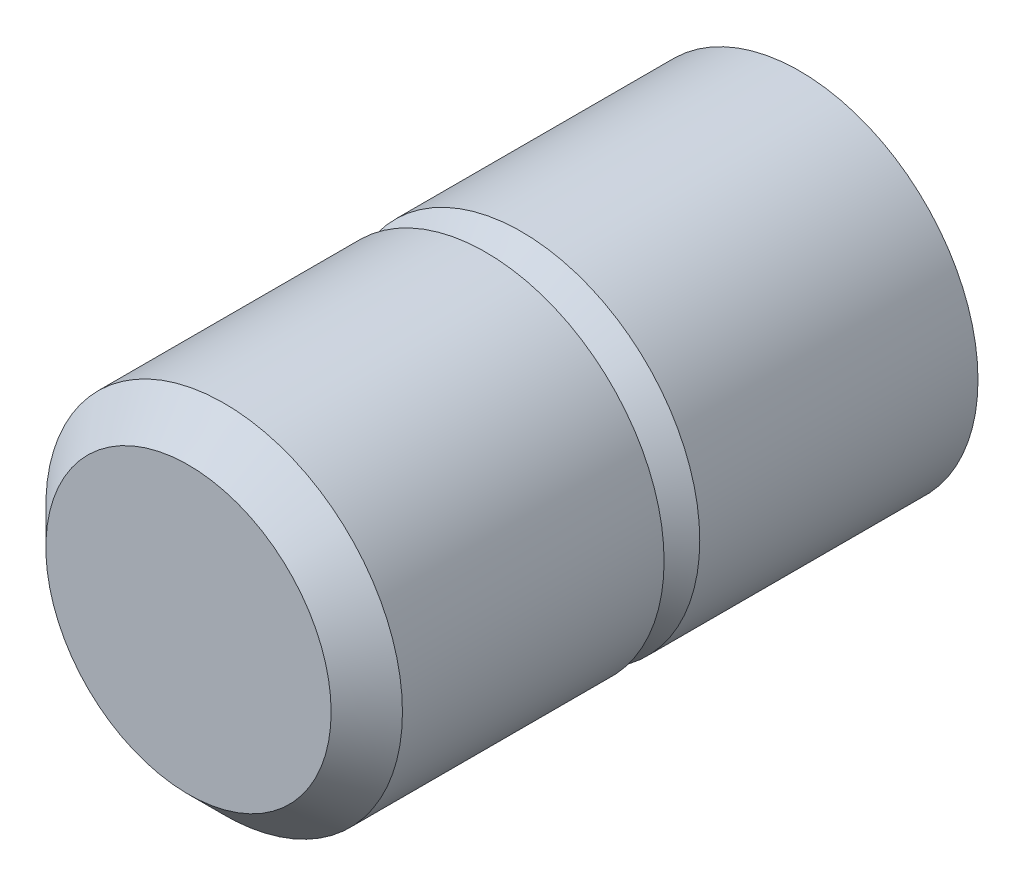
from build123d import *

# Parameters (mm, degrees)
SKETCH2_R       = 53.975
TYPE123_N_DEPTH = 35.093531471


with BuildPart() as part:
    # Sketch1 → Revolve1 (revolve)
    with BuildSketch(Plane(origin=(0, 0, 0), x_dir=(0, 0, -1), z_dir=(1, 0, 0)), mode=Mode.PRIVATE) as revolve1_sk:
        Polygon((0, 0), (0, 4.801616), (1.200404, 6.00202), (10.0076, 6.00202), (10.0076, 4.801616), (11.208004, 6.00202), (20.574, 6.00202), (20.574, 4.64058), (21.60524, 5.1562), (52.56276, 5.1562), (53.594, 4.12496), (53.594, 0), align=None)
    revolve(revolve1_sk.sketch.rotate(Axis((0, 0, 0), (0, 0, -1)), 90), axis=Axis((0, 0, 0), (0, 0, -1)))

    # Sketch2 → Type123-N (cut, through all)
    with BuildSketch(Plane(origin=(0, 0, -20.574), x_dir=(-1, 0, 0), z_dir=(0, 0, -1))):
        Circle(SKETCH2_R)
    extrude(amount=TYPE123_N_DEPTH, mode=Mode.SUBTRACT)


solid = part.part
